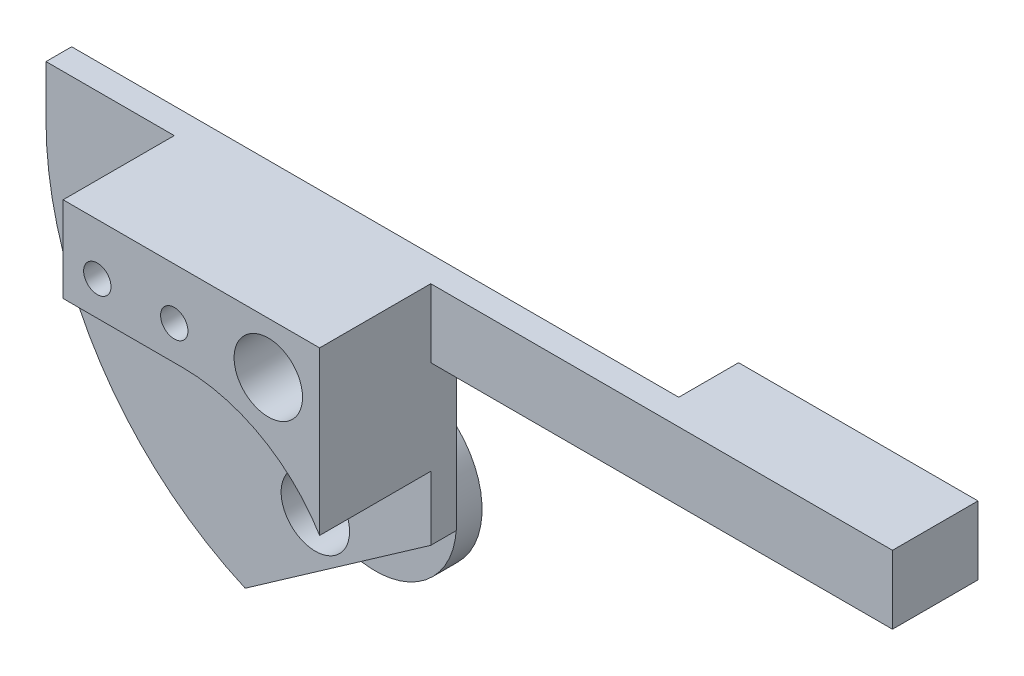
ISO-10303-21;
HEADER;
FILE_DESCRIPTION(('STEP AP214'),'2;1');
FILE_NAME('part.step','',(''),(''),'','','');
FILE_SCHEMA(('AUTOMOTIVE_DESIGN { 1 0 10303 214 1 1 1 1 }'));
ENDSEC;
DATA;
#1=APPLICATION_CONTEXT('core data for automotive mechanical design processes');
#2=APPLICATION_PROTOCOL_DEFINITION('international standard','automotive_design',2000,#1);
#3=PRODUCT_CONTEXT('',#1,'mechanical');
#4=PRODUCT('Part','Part','',(#3));
#5=PRODUCT_RELATED_PRODUCT_CATEGORY('part','',(#4));
#6=PRODUCT_DEFINITION_FORMATION('','',#4);
#7=PRODUCT_DEFINITION_CONTEXT('part definition',#1,'design');
#8=PRODUCT_DEFINITION('design','',#6,#7);
#9=PRODUCT_DEFINITION_SHAPE('','',#8);
#10=(LENGTH_UNIT() NAMED_UNIT(*) SI_UNIT(.MILLI.,.METRE.));
#11=(NAMED_UNIT(*) PLANE_ANGLE_UNIT() SI_UNIT($,.RADIAN.));
#12=(NAMED_UNIT(*) SI_UNIT($,.STERADIAN.) SOLID_ANGLE_UNIT());
#13=UNCERTAINTY_MEASURE_WITH_UNIT(LENGTH_MEASURE(1.E-05),#10,'distance_accuracy_value','');
#14=(GEOMETRIC_REPRESENTATION_CONTEXT(3) GLOBAL_UNCERTAINTY_ASSIGNED_CONTEXT((#13)) GLOBAL_UNIT_ASSIGNED_CONTEXT((#10,
#11,#12)) REPRESENTATION_CONTEXT('',''));
#15=CARTESIAN_POINT('',(0.,0.,0.));
#16=DIRECTION('',(0.,0.,1.));
#17=DIRECTION('',(1.,0.,0.));
#18=AXIS2_PLACEMENT_3D('',#15,#16,#17);
#19=CARTESIAN_POINT('',(35.,68.,0.));
#20=DIRECTION('',(0.,0.,1.));
#21=DIRECTION('',(1.,0.,0.));
#22=AXIS2_PLACEMENT_3D('',#19,#20,#21);
#23=PLANE('',#22);
#24=CARTESIAN_POINT('',(35.,68.,0.));
#25=DIRECTION('',(0.,0.,1.));
#26=DIRECTION('',(1.,0.,0.));
#27=AXIS2_PLACEMENT_3D('',#24,#25,#26);
#28=CIRCLE('',#27,2.);
#29=CARTESIAN_POINT('',(37.,68.,0.));
#30=VERTEX_POINT('',#29);
#31=EDGE_CURVE('E192',#30,#30,#28,.T.);
#32=ORIENTED_EDGE('',*,*,#31,.T.);
#33=EDGE_LOOP('',(#32));
#34=FACE_BOUND('',#33,.T.);
#35=DIRECTION('',(0.,1.,0.));
#36=VECTOR('',#35,1.);
#37=CARTESIAN_POINT('',(38.,48.7321511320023,0.));
#38=LINE('',#37,#36);
#39=CARTESIAN_POINT('',(38.,57.7502243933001,0.));
#40=VERTEX_POINT('',#39);
#41=CARTESIAN_POINT('',(38.,67.,0.));
#42=VERTEX_POINT('',#41);
#43=EDGE_CURVE('E230',#40,#42,#38,.T.);
#44=ORIENTED_EDGE('',*,*,#43,.F.);
#45=DIRECTION('',(-0.819152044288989,-0.57357643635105,0.));
#46=VECTOR('',#45,1.);
#47=CARTESIAN_POINT('',(40.8027890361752,59.7127584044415,0.));
#48=LINE('',#47,#46);
#49=CARTESIAN_POINT('',(35.9923926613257,56.3444826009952,0.));
#50=VERTEX_POINT('',#49);
#51=EDGE_CURVE('E166',#40,#50,#48,.T.);
#52=ORIENTED_EDGE('',*,*,#51,.T.);
#53=CARTESIAN_POINT('',(31.25,56.0757599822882,0.));
#54=DIRECTION('',(0.,0.,1.));
#55=DIRECTION('',(1.,0.,0.));
#56=AXIS2_PLACEMENT_3D('',#53,#54,#55);
#57=CIRCLE('',#56,4.75000000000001);
#58=CARTESIAN_POINT('',(29.3754895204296,51.7112771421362,0.));
#59=VERTEX_POINT('',#58);
#60=EDGE_CURVE('E295',#59,#50,#57,.F.);
#61=ORIENTED_EDGE('',*,*,#60,.F.);
#62=CARTESIAN_POINT('',(27.1472697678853,50.1510608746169,0.));
#63=VERTEX_POINT('',#62);
#64=EDGE_CURVE('E325',#59,#63,#48,.T.);
#65=ORIENTED_EDGE('',*,*,#64,.T.);
#66=CARTESIAN_POINT('',(35.,68.,0.));
#67=DIRECTION('',(0.,0.,1.));
#68=DIRECTION('',(1.,0.,0.));
#69=AXIS2_PLACEMENT_3D('',#66,#67,#68);
#70=CIRCLE('',#69,19.5);
#71=CARTESIAN_POINT('',(15.5,68.,0.));
#72=VERTEX_POINT('',#71);
#73=EDGE_CURVE('E322',#72,#63,#70,.T.);
#74=ORIENTED_EDGE('',*,*,#73,.F.);
#75=DIRECTION('',(0.,-1.,0.));
#76=VECTOR('',#75,1.);
#77=CARTESIAN_POINT('',(15.5,68.,0.));
#78=LINE('',#77,#76);
#79=CARTESIAN_POINT('',(15.5,71.,0.));
#80=VERTEX_POINT('',#79);
#81=EDGE_CURVE('E187',#80,#72,#78,.T.);
#82=ORIENTED_EDGE('',*,*,#81,.F.);
#83=DIRECTION('',(-1.,0.,0.));
#84=VECTOR('',#83,1.);
#85=CARTESIAN_POINT('',(15.5,71.,0.));
#86=LINE('',#85,#84);
#87=CARTESIAN_POINT('',(51.,71.,0.));
#88=VERTEX_POINT('',#87);
#89=EDGE_CURVE('E189',#88,#80,#86,.T.);
#90=ORIENTED_EDGE('',*,*,#89,.F.);
#91=DIRECTION('',(0.,1.,0.));
#92=VECTOR('',#91,1.);
#93=CARTESIAN_POINT('',(51.,71.,0.));
#94=LINE('',#93,#92);
#95=CARTESIAN_POINT('',(51.,67.,0.));
#96=VERTEX_POINT('',#95);
#97=EDGE_CURVE('E63',#96,#88,#94,.T.);
#98=ORIENTED_EDGE('',*,*,#97,.F.);
#99=DIRECTION('',(1.,0.,0.));
#100=VECTOR('',#99,1.);
#101=CARTESIAN_POINT('',(38.,67.,0.));
#102=LINE('',#101,#100);
#103=EDGE_CURVE('E226',#42,#96,#102,.T.);
#104=ORIENTED_EDGE('',*,*,#103,.F.);
#105=EDGE_LOOP('',(#44,#52,#61,#65,#74,#82,#90,#98,#104));
#106=FACE_BOUND('',#105,.T.);
#107=ADVANCED_FACE('F39',(#34,#106),#23,.F.);
#108=CARTESIAN_POINT('',(35.,68.,1.5));
#109=DIRECTION('',(0.,0.,1.));
#110=DIRECTION('',(1.,0.,0.));
#111=AXIS2_PLACEMENT_3D('',#108,#109,#110);
#112=PLANE('',#111);
#113=DIRECTION('',(0.,1.,0.));
#114=VECTOR('',#113,1.);
#115=CARTESIAN_POINT('',(38.,71.,1.5));
#116=LINE('',#115,#114);
#117=CARTESIAN_POINT('',(38.,67.,1.5));
#118=VERTEX_POINT('',#117);
#119=CARTESIAN_POINT('',(38.,71.,1.5));
#120=VERTEX_POINT('',#119);
#121=EDGE_CURVE('E289',#118,#120,#116,.T.);
#122=ORIENTED_EDGE('',*,*,#121,.F.);
#123=DIRECTION('',(1.,0.,0.));
#124=VECTOR('',#123,1.);
#125=CARTESIAN_POINT('',(38.,67.,1.5));
#126=LINE('',#125,#124);
#127=CARTESIAN_POINT('',(65.,67.,1.5));
#128=VERTEX_POINT('',#127);
#129=EDGE_CURVE('E184',#118,#128,#126,.T.);
#130=ORIENTED_EDGE('',*,*,#129,.T.);
#131=DIRECTION('',(0.,1.,0.));
#132=VECTOR('',#131,1.);
#133=CARTESIAN_POINT('',(65.,71.,1.5));
#134=LINE('',#133,#132);
#135=CARTESIAN_POINT('',(65.,71.,1.5));
#136=VERTEX_POINT('',#135);
#137=EDGE_CURVE('E185',#128,#136,#134,.T.);
#138=ORIENTED_EDGE('',*,*,#137,.T.);
#139=DIRECTION('',(-1.,0.,0.));
#140=VECTOR('',#139,1.);
#141=CARTESIAN_POINT('',(15.5,71.,1.5));
#142=LINE('',#141,#140);
#143=EDGE_CURVE('E206',#136,#120,#142,.T.);
#144=ORIENTED_EDGE('',*,*,#143,.T.);
#145=EDGE_LOOP('',(#122,#130,#138,#144));
#146=FACE_BOUND('',#145,.T.);
#147=ADVANCED_FACE('F402',(#146),#112,.T.);
#148=DIRECTION('',(-0.819152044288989,-0.57357643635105,0.));
#149=VECTOR('',#148,1.);
#150=CARTESIAN_POINT('',(38.,57.7502243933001,1.5));
#151=LINE('',#150,#149);
#152=CARTESIAN_POINT('',(38.,57.7502243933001,1.5));
#153=VERTEX_POINT('',#152);
#154=CARTESIAN_POINT('',(27.1472697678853,50.1510608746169,1.5));
#155=VERTEX_POINT('',#154);
#156=EDGE_CURVE('E163',#153,#155,#151,.T.);
#157=ORIENTED_EDGE('',*,*,#156,.F.);
#158=DIRECTION('',(0.,1.,0.));
#159=VECTOR('',#158,1.);
#160=CARTESIAN_POINT('',(38.,48.7321511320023,1.5));
#161=LINE('',#160,#159);
#162=CARTESIAN_POINT('',(38.,61.5,1.5));
#163=VERTEX_POINT('',#162);
#164=EDGE_CURVE('E43',#153,#163,#161,.T.);
#165=ORIENTED_EDGE('',*,*,#164,.T.);
#166=CARTESIAN_POINT('',(30.,56.638888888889,1.5));
#167=DIRECTION('',(0.,0.,-1.));
#168=DIRECTION('',(1.,0.,0.));
#169=AXIS2_PLACEMENT_3D('',#166,#167,#168);
#170=CIRCLE('',#169,9.36111111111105);
#171=CARTESIAN_POINT('',(30.,66.,1.5));
#172=VERTEX_POINT('',#171);
#173=EDGE_CURVE('E251',#172,#163,#170,.T.);
#174=ORIENTED_EDGE('',*,*,#173,.F.);
#175=DIRECTION('',(1.,0.,0.));
#176=VECTOR('',#175,1.);
#177=CARTESIAN_POINT('',(23.,66.,1.5));
#178=LINE('',#177,#176);
#179=CARTESIAN_POINT('',(23.,66.,1.5));
#180=VERTEX_POINT('',#179);
#181=EDGE_CURVE('E260',#180,#172,#178,.T.);
#182=ORIENTED_EDGE('',*,*,#181,.F.);
#183=DIRECTION('',(0.,-1.,0.));
#184=VECTOR('',#183,1.);
#185=CARTESIAN_POINT('',(23.,71.,1.5));
#186=LINE('',#185,#184);
#187=CARTESIAN_POINT('',(23.,71.,1.5));
#188=VERTEX_POINT('',#187);
#189=EDGE_CURVE('E245',#188,#180,#186,.T.);
#190=ORIENTED_EDGE('',*,*,#189,.F.);
#191=CARTESIAN_POINT('',(15.5,71.,1.5));
#192=VERTEX_POINT('',#191);
#193=EDGE_CURVE('E197',#188,#192,#142,.T.);
#194=ORIENTED_EDGE('',*,*,#193,.T.);
#195=DIRECTION('',(0.,-1.,0.));
#196=VECTOR('',#195,1.);
#197=CARTESIAN_POINT('',(15.5,68.,1.5));
#198=LINE('',#197,#196);
#199=CARTESIAN_POINT('',(15.5,68.,1.5));
#200=VERTEX_POINT('',#199);
#201=EDGE_CURVE('E200',#192,#200,#198,.T.);
#202=ORIENTED_EDGE('',*,*,#201,.T.);
#203=CARTESIAN_POINT('',(35.,68.,1.5));
#204=DIRECTION('',(0.,0.,1.));
#205=DIRECTION('',(1.,0.,0.));
#206=AXIS2_PLACEMENT_3D('',#203,#204,#205);
#207=CIRCLE('',#206,19.5);
#208=EDGE_CURVE('E177',#200,#155,#207,.T.);
#209=ORIENTED_EDGE('',*,*,#208,.T.);
#210=EDGE_LOOP('',(#157,#165,#174,#182,#190,#194,#202,#209));
#211=FACE_BOUND('',#210,.T.);
#212=CARTESIAN_POINT('',(31.25,56.0757599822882,1.5));
#213=DIRECTION('',(0.,0.,1.));
#214=DIRECTION('',(1.,0.,0.));
#215=AXIS2_PLACEMENT_3D('',#212,#213,#214);
#216=CIRCLE('',#215,2.);
#217=CARTESIAN_POINT('',(33.25,56.0757599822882,1.5));
#218=VERTEX_POINT('',#217);
#219=EDGE_CURVE('E340',#218,#218,#216,.T.);
#220=ORIENTED_EDGE('',*,*,#219,.F.);
#221=EDGE_LOOP('',(#220));
#222=FACE_BOUND('',#221,.T.);
#223=ADVANCED_FACE('F173',(#211,#222),#112,.T.);
#224=CARTESIAN_POINT('',(35.,68.,1.5));
#225=DIRECTION('',(0.,0.,-1.));
#226=DIRECTION('',(-1.,0.,0.));
#227=AXIS2_PLACEMENT_3D('',#224,#225,#226);
#228=CYLINDRICAL_SURFACE('',#227,19.5);
#229=ORIENTED_EDGE('',*,*,#73,.T.);
#230=DIRECTION('',(0.,0.,-1.));
#231=VECTOR('',#230,1.);
#232=CARTESIAN_POINT('',(27.1472697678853,50.1510608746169,1.5));
#233=LINE('',#232,#231);
#234=EDGE_CURVE('E321',#63,#155,#233,.F.);
#235=ORIENTED_EDGE('',*,*,#234,.T.);
#236=ORIENTED_EDGE('',*,*,#208,.F.);
#237=DIRECTION('',(0.,0.,-1.));
#238=VECTOR('',#237,1.);
#239=CARTESIAN_POINT('',(15.5,68.,1.5));
#240=LINE('',#239,#238);
#241=EDGE_CURVE('E216',#200,#72,#240,.T.);
#242=ORIENTED_EDGE('',*,*,#241,.T.);
#243=EDGE_LOOP('',(#229,#235,#236,#242));
#244=FACE_BOUND('',#243,.T.);
#245=ADVANCED_FACE('F41',(#244),#228,.T.);
#246=CARTESIAN_POINT('',(38.,48.7321511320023,1.5));
#247=DIRECTION('',(-1.,0.,0.));
#248=DIRECTION('',(0.,-1.,0.));
#249=AXIS2_PLACEMENT_3D('',#246,#247,#248);
#250=PLANE('',#249);
#251=ORIENTED_EDGE('',*,*,#164,.F.);
#252=DIRECTION('',(0.,0.,1.));
#253=VECTOR('',#252,1.);
#254=CARTESIAN_POINT('',(38.,57.7502243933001,-2.));
#255=LINE('',#254,#253);
#256=EDGE_CURVE('E160',#40,#153,#255,.T.);
#257=ORIENTED_EDGE('',*,*,#256,.F.);
#258=ORIENTED_EDGE('',*,*,#43,.T.);
#259=DIRECTION('',(0.,0.,-1.));
#260=VECTOR('',#259,1.);
#261=CARTESIAN_POINT('',(38.,67.,1.5));
#262=LINE('',#261,#260);
#263=EDGE_CURVE('E210',#118,#42,#262,.T.);
#264=ORIENTED_EDGE('',*,*,#263,.F.);
#265=ORIENTED_EDGE('',*,*,#121,.T.);
#266=DIRECTION('',(0.,0.,-1.));
#267=VECTOR('',#266,1.);
#268=CARTESIAN_POINT('',(38.,71.,8.));
#269=LINE('',#268,#267);
#270=CARTESIAN_POINT('',(38.,71.,8.));
#271=VERTEX_POINT('',#270);
#272=EDGE_CURVE('E271',#271,#120,#269,.T.);
#273=ORIENTED_EDGE('',*,*,#272,.F.);
#274=DIRECTION('',(0.,1.,0.));
#275=VECTOR('',#274,1.);
#276=CARTESIAN_POINT('',(38.,71.,8.));
#277=LINE('',#276,#275);
#278=CARTESIAN_POINT('',(38.,61.5,8.));
#279=VERTEX_POINT('',#278);
#280=EDGE_CURVE('E255',#279,#271,#277,.T.);
#281=ORIENTED_EDGE('',*,*,#280,.F.);
#282=DIRECTION('',(0.,0.,-1.));
#283=VECTOR('',#282,1.);
#284=CARTESIAN_POINT('',(38.,61.5,8.));
#285=LINE('',#284,#283);
#286=EDGE_CURVE('E183',#279,#163,#285,.T.);
#287=ORIENTED_EDGE('',*,*,#286,.T.);
#288=EDGE_LOOP('',(#251,#257,#258,#264,#265,#273,#281,#287));
#289=FACE_BOUND('',#288,.T.);
#290=ADVANCED_FACE('F180',(#289),#250,.F.);
#291=CARTESIAN_POINT('',(38.,67.,1.5));
#292=DIRECTION('',(0.,1.,0.));
#293=DIRECTION('',(0.,0.,1.));
#294=AXIS2_PLACEMENT_3D('',#291,#292,#293);
#295=PLANE('',#294);
#296=CARTESIAN_POINT('',(58.,67.,-1.));
#297=DIRECTION('',(0.,-1.,0.));
#298=DIRECTION('',(0.,0.,-1.));
#299=AXIS2_PLACEMENT_3D('',#296,#297,#298);
#300=CIRCLE('',#299,2.);
#301=CARTESIAN_POINT('',(58.,67.,-3.));
#302=VERTEX_POINT('',#301);
#303=EDGE_CURVE('E347',#302,#302,#300,.T.);
#304=ORIENTED_EDGE('',*,*,#303,.F.);
#305=EDGE_LOOP('',(#304));
#306=FACE_BOUND('',#305,.T.);
#307=ORIENTED_EDGE('',*,*,#103,.T.);
#308=DIRECTION('',(0.,0.,1.));
#309=VECTOR('',#308,1.);
#310=CARTESIAN_POINT('',(51.,67.,-3.5));
#311=LINE('',#310,#309);
#312=CARTESIAN_POINT('',(51.,67.,-3.5));
#313=VERTEX_POINT('',#312);
#314=EDGE_CURVE('E246',#313,#96,#311,.T.);
#315=ORIENTED_EDGE('',*,*,#314,.F.);
#316=DIRECTION('',(-1.,0.,0.));
#317=VECTOR('',#316,1.);
#318=CARTESIAN_POINT('',(65.,67.,-3.5));
#319=LINE('',#318,#317);
#320=CARTESIAN_POINT('',(65.,67.,-3.5));
#321=VERTEX_POINT('',#320);
#322=EDGE_CURVE('E354',#321,#313,#319,.T.);
#323=ORIENTED_EDGE('',*,*,#322,.F.);
#324=DIRECTION('',(0.,0.,-1.));
#325=VECTOR('',#324,1.);
#326=CARTESIAN_POINT('',(65.,67.,1.5));
#327=LINE('',#326,#325);
#328=EDGE_CURVE('E208',#128,#321,#327,.T.);
#329=ORIENTED_EDGE('',*,*,#328,.F.);
#330=ORIENTED_EDGE('',*,*,#129,.F.);
#331=ORIENTED_EDGE('',*,*,#263,.T.);
#332=EDGE_LOOP('',(#307,#315,#323,#329,#330,#331));
#333=FACE_BOUND('',#332,.T.);
#334=ADVANCED_FACE('F419',(#306,#333),#295,.F.);
#335=CARTESIAN_POINT('',(65.,71.,1.5));
#336=DIRECTION('',(-1.,0.,0.));
#337=DIRECTION('',(0.,0.,1.));
#338=AXIS2_PLACEMENT_3D('',#335,#336,#337);
#339=PLANE('',#338);
#340=ORIENTED_EDGE('',*,*,#328,.T.);
#341=DIRECTION('',(0.,-1.,0.));
#342=VECTOR('',#341,1.);
#343=CARTESIAN_POINT('',(65.,71.,-3.5));
#344=LINE('',#343,#342);
#345=CARTESIAN_POINT('',(65.,71.,-3.5));
#346=VERTEX_POINT('',#345);
#347=EDGE_CURVE('E233',#346,#321,#344,.T.);
#348=ORIENTED_EDGE('',*,*,#347,.F.);
#349=DIRECTION('',(0.,0.,-1.));
#350=VECTOR('',#349,1.);
#351=CARTESIAN_POINT('',(65.,71.,1.5));
#352=LINE('',#351,#350);
#353=EDGE_CURVE('E211',#136,#346,#352,.T.);
#354=ORIENTED_EDGE('',*,*,#353,.F.);
#355=ORIENTED_EDGE('',*,*,#137,.F.);
#356=EDGE_LOOP('',(#340,#348,#354,#355));
#357=FACE_BOUND('',#356,.T.);
#358=ADVANCED_FACE('F416',(#357),#339,.F.);
#359=CARTESIAN_POINT('',(15.5,71.,1.5));
#360=DIRECTION('',(0.,-1.,0.));
#361=DIRECTION('',(0.,0.,-1.));
#362=AXIS2_PLACEMENT_3D('',#359,#360,#361);
#363=PLANE('',#362);
#364=ORIENTED_EDGE('',*,*,#353,.T.);
#365=DIRECTION('',(1.,0.,0.));
#366=VECTOR('',#365,1.);
#367=CARTESIAN_POINT('',(65.,71.,-3.5));
#368=LINE('',#367,#366);
#369=CARTESIAN_POINT('',(51.,71.,-3.5));
#370=VERTEX_POINT('',#369);
#371=EDGE_CURVE('E240',#370,#346,#368,.T.);
#372=ORIENTED_EDGE('',*,*,#371,.F.);
#373=DIRECTION('',(0.,0.,1.));
#374=VECTOR('',#373,1.);
#375=CARTESIAN_POINT('',(51.,71.,-3.5));
#376=LINE('',#375,#374);
#377=EDGE_CURVE('E235',#370,#88,#376,.T.);
#378=ORIENTED_EDGE('',*,*,#377,.T.);
#379=ORIENTED_EDGE('',*,*,#89,.T.);
#380=DIRECTION('',(0.,0.,-1.));
#381=VECTOR('',#380,1.);
#382=CARTESIAN_POINT('',(15.5,71.,1.5));
#383=LINE('',#382,#381);
#384=EDGE_CURVE('E213',#192,#80,#383,.T.);
#385=ORIENTED_EDGE('',*,*,#384,.F.);
#386=ORIENTED_EDGE('',*,*,#193,.F.);
#387=DIRECTION('',(0.,0.,-1.));
#388=VECTOR('',#387,1.);
#389=CARTESIAN_POINT('',(23.,71.,8.));
#390=LINE('',#389,#388);
#391=CARTESIAN_POINT('',(23.,71.,8.));
#392=VERTEX_POINT('',#391);
#393=EDGE_CURVE('E259',#392,#188,#390,.T.);
#394=ORIENTED_EDGE('',*,*,#393,.F.);
#395=DIRECTION('',(-1.,0.,0.));
#396=VECTOR('',#395,1.);
#397=CARTESIAN_POINT('',(23.,71.,8.));
#398=LINE('',#397,#396);
#399=EDGE_CURVE('E257',#271,#392,#398,.T.);
#400=ORIENTED_EDGE('',*,*,#399,.F.);
#401=ORIENTED_EDGE('',*,*,#272,.T.);
#402=ORIENTED_EDGE('',*,*,#143,.F.);
#403=EDGE_LOOP('',(#364,#372,#378,#379,#385,#386,#394,#400,#401,#402));
#404=FACE_BOUND('',#403,.T.);
#405=ADVANCED_FACE('F311',(#404),#363,.F.);
#406=CARTESIAN_POINT('',(15.5,68.,1.5));
#407=DIRECTION('',(1.,0.,0.));
#408=DIRECTION('',(0.,0.,-1.));
#409=AXIS2_PLACEMENT_3D('',#406,#407,#408);
#410=PLANE('',#409);
#411=ORIENTED_EDGE('',*,*,#81,.T.);
#412=ORIENTED_EDGE('',*,*,#241,.F.);
#413=ORIENTED_EDGE('',*,*,#201,.F.);
#414=ORIENTED_EDGE('',*,*,#384,.T.);
#415=EDGE_LOOP('',(#411,#412,#413,#414));
#416=FACE_BOUND('',#415,.T.);
#417=ADVANCED_FACE('F317',(#416),#410,.F.);
#418=CARTESIAN_POINT('',(35.,68.,1.5));
#419=DIRECTION('',(0.,0.,-1.));
#420=DIRECTION('',(-1.,0.,0.));
#421=AXIS2_PLACEMENT_3D('',#418,#419,#420);
#422=CYLINDRICAL_SURFACE('',#421,2.);
#423=ORIENTED_EDGE('',*,*,#31,.F.);
#424=EDGE_LOOP('',(#423));
#425=FACE_BOUND('',#424,.T.);
#426=CARTESIAN_POINT('',(35.,68.,8.));
#427=DIRECTION('',(0.,0.,1.));
#428=DIRECTION('',(1.,0.,0.));
#429=AXIS2_PLACEMENT_3D('',#426,#427,#428);
#430=CIRCLE('',#429,2.);
#431=CARTESIAN_POINT('',(37.,68.,8.));
#432=VERTEX_POINT('',#431);
#433=EDGE_CURVE('E242',#432,#432,#430,.T.);
#434=ORIENTED_EDGE('',*,*,#433,.T.);
#435=EDGE_LOOP('',(#434));
#436=FACE_BOUND('',#435,.T.);
#437=ADVANCED_FACE('F413',(#425,#436),#422,.F.);
#438=CARTESIAN_POINT('',(30.,56.638888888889,8.));
#439=DIRECTION('',(0.,0.,1.));
#440=DIRECTION('',(1.,0.,0.));
#441=AXIS2_PLACEMENT_3D('',#438,#439,#440);
#442=PLANE('',#441);
#443=CARTESIAN_POINT('',(25.,68.,8.));
#444=DIRECTION('',(0.,0.,1.));
#445=DIRECTION('',(1.,0.,0.));
#446=AXIS2_PLACEMENT_3D('',#443,#444,#445);
#447=CIRCLE('',#446,0.799999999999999);
#448=CARTESIAN_POINT('',(25.8,68.,8.));
#449=VERTEX_POINT('',#448);
#450=EDGE_CURVE('E324',#449,#449,#447,.T.);
#451=ORIENTED_EDGE('',*,*,#450,.F.);
#452=EDGE_LOOP('',(#451));
#453=FACE_BOUND('',#452,.T.);
#454=CARTESIAN_POINT('',(29.5,68.,8.));
#455=DIRECTION('',(0.,0.,1.));
#456=DIRECTION('',(1.,0.,0.));
#457=AXIS2_PLACEMENT_3D('',#454,#455,#456);
#458=CIRCLE('',#457,0.799999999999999);
#459=CARTESIAN_POINT('',(30.3,68.,8.));
#460=VERTEX_POINT('',#459);
#461=EDGE_CURVE('E334',#460,#460,#458,.T.);
#462=ORIENTED_EDGE('',*,*,#461,.F.);
#463=EDGE_LOOP('',(#462));
#464=FACE_BOUND('',#463,.T.);
#465=DIRECTION('',(0.,-1.,0.));
#466=VECTOR('',#465,1.);
#467=CARTESIAN_POINT('',(23.,71.,8.));
#468=LINE('',#467,#466);
#469=CARTESIAN_POINT('',(23.,66.,8.));
#470=VERTEX_POINT('',#469);
#471=EDGE_CURVE('E247',#392,#470,#468,.T.);
#472=ORIENTED_EDGE('',*,*,#471,.T.);
#473=DIRECTION('',(1.,0.,0.));
#474=VECTOR('',#473,1.);
#475=CARTESIAN_POINT('',(23.,66.,8.));
#476=LINE('',#475,#474);
#477=CARTESIAN_POINT('',(30.,66.,8.));
#478=VERTEX_POINT('',#477);
#479=EDGE_CURVE('E250',#470,#478,#476,.T.);
#480=ORIENTED_EDGE('',*,*,#479,.T.);
#481=CARTESIAN_POINT('',(30.,56.638888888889,8.));
#482=DIRECTION('',(0.,0.,-1.));
#483=DIRECTION('',(1.,0.,0.));
#484=AXIS2_PLACEMENT_3D('',#481,#482,#483);
#485=CIRCLE('',#484,9.36111111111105);
#486=EDGE_CURVE('E253',#478,#279,#485,.T.);
#487=ORIENTED_EDGE('',*,*,#486,.T.);
#488=ORIENTED_EDGE('',*,*,#280,.T.);
#489=ORIENTED_EDGE('',*,*,#399,.T.);
#490=EDGE_LOOP('',(#472,#480,#487,#488,#489));
#491=FACE_BOUND('',#490,.T.);
#492=ORIENTED_EDGE('',*,*,#433,.F.);
#493=EDGE_LOOP('',(#492));
#494=FACE_BOUND('',#493,.T.);
#495=ADVANCED_FACE('F386',(#453,#464,#491,#494),#442,.T.);
#496=CARTESIAN_POINT('',(23.,71.,8.));
#497=DIRECTION('',(1.,0.,0.));
#498=DIRECTION('',(0.,0.,-1.));
#499=AXIS2_PLACEMENT_3D('',#496,#497,#498);
#500=PLANE('',#499);
#501=ORIENTED_EDGE('',*,*,#189,.T.);
#502=DIRECTION('',(0.,0.,-1.));
#503=VECTOR('',#502,1.);
#504=CARTESIAN_POINT('',(23.,66.,8.));
#505=LINE('',#504,#503);
#506=EDGE_CURVE('E273',#470,#180,#505,.T.);
#507=ORIENTED_EDGE('',*,*,#506,.F.);
#508=ORIENTED_EDGE('',*,*,#471,.F.);
#509=ORIENTED_EDGE('',*,*,#393,.T.);
#510=EDGE_LOOP('',(#501,#507,#508,#509));
#511=FACE_BOUND('',#510,.T.);
#512=ADVANCED_FACE('F305',(#511),#500,.F.);
#513=CARTESIAN_POINT('',(23.,66.,8.));
#514=DIRECTION('',(0.,1.,0.));
#515=DIRECTION('',(-1.,0.,0.));
#516=AXIS2_PLACEMENT_3D('',#513,#514,#515);
#517=PLANE('',#516);
#518=ORIENTED_EDGE('',*,*,#181,.T.);
#519=DIRECTION('',(0.,0.,-1.));
#520=VECTOR('',#519,1.);
#521=CARTESIAN_POINT('',(30.,66.,8.));
#522=LINE('',#521,#520);
#523=EDGE_CURVE('E270',#478,#172,#522,.T.);
#524=ORIENTED_EDGE('',*,*,#523,.F.);
#525=ORIENTED_EDGE('',*,*,#479,.F.);
#526=ORIENTED_EDGE('',*,*,#506,.T.);
#527=EDGE_LOOP('',(#518,#524,#525,#526));
#528=FACE_BOUND('',#527,.T.);
#529=ADVANCED_FACE('F382',(#528),#517,.F.);
#530=CARTESIAN_POINT('',(30.,56.638888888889,8.));
#531=DIRECTION('',(0.,0.,-1.));
#532=DIRECTION('',(-1.,0.,0.));
#533=AXIS2_PLACEMENT_3D('',#530,#531,#532);
#534=CYLINDRICAL_SURFACE('',#533,9.36111111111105);
#535=ORIENTED_EDGE('',*,*,#173,.T.);
#536=ORIENTED_EDGE('',*,*,#286,.F.);
#537=ORIENTED_EDGE('',*,*,#486,.F.);
#538=ORIENTED_EDGE('',*,*,#523,.T.);
#539=EDGE_LOOP('',(#535,#536,#537,#538));
#540=FACE_BOUND('',#539,.T.);
#541=ADVANCED_FACE('F389',(#540),#534,.F.);
#542=CARTESIAN_POINT('',(51.,71.,-3.5));
#543=DIRECTION('',(1.,0.,0.));
#544=DIRECTION('',(0.,0.,-1.));
#545=AXIS2_PLACEMENT_3D('',#542,#543,#544);
#546=PLANE('',#545);
#547=ORIENTED_EDGE('',*,*,#97,.T.);
#548=ORIENTED_EDGE('',*,*,#377,.F.);
#549=DIRECTION('',(0.,1.,0.));
#550=VECTOR('',#549,1.);
#551=CARTESIAN_POINT('',(51.,71.,-3.5));
#552=LINE('',#551,#550);
#553=EDGE_CURVE('E355',#313,#370,#552,.T.);
#554=ORIENTED_EDGE('',*,*,#553,.F.);
#555=ORIENTED_EDGE('',*,*,#314,.T.);
#556=EDGE_LOOP('',(#547,#548,#554,#555));
#557=FACE_BOUND('',#556,.T.);
#558=ADVANCED_FACE('F391',(#557),#546,.F.);
#559=CARTESIAN_POINT('',(0.,0.,-3.5));
#560=DIRECTION('',(0.,0.,-1.));
#561=DIRECTION('',(-1.,0.,0.));
#562=AXIS2_PLACEMENT_3D('',#559,#560,#561);
#563=PLANE('',#562);
#564=ORIENTED_EDGE('',*,*,#347,.T.);
#565=ORIENTED_EDGE('',*,*,#322,.T.);
#566=ORIENTED_EDGE('',*,*,#553,.T.);
#567=ORIENTED_EDGE('',*,*,#371,.T.);
#568=EDGE_LOOP('',(#564,#565,#566,#567));
#569=FACE_BOUND('',#568,.T.);
#570=ADVANCED_FACE('F397',(#569),#563,.T.);
#571=CARTESIAN_POINT('',(58.,70.,-1.));
#572=DIRECTION('',(0.,-1.,0.));
#573=DIRECTION('',(0.,0.,-1.));
#574=AXIS2_PLACEMENT_3D('',#571,#572,#573);
#575=CYLINDRICAL_SURFACE('',#574,2.);
#576=CARTESIAN_POINT('',(58.,70.,-1.));
#577=DIRECTION('',(0.,-1.,0.));
#578=DIRECTION('',(0.,0.,-1.));
#579=AXIS2_PLACEMENT_3D('',#576,#577,#578);
#580=CIRCLE('',#579,2.);
#581=CARTESIAN_POINT('',(58.,70.,-3.));
#582=VERTEX_POINT('',#581);
#583=EDGE_CURVE('E234',#582,#582,#580,.T.);
#584=ORIENTED_EDGE('',*,*,#583,.F.);
#585=EDGE_LOOP('',(#584));
#586=FACE_BOUND('',#585,.T.);
#587=ORIENTED_EDGE('',*,*,#303,.T.);
#588=EDGE_LOOP('',(#587));
#589=FACE_BOUND('',#588,.T.);
#590=ADVANCED_FACE('F499',(#586,#589),#575,.F.);
#591=CARTESIAN_POINT('',(58.,70.,-1.));
#592=DIRECTION('',(0.,-1.,0.));
#593=DIRECTION('',(0.,0.,-1.));
#594=AXIS2_PLACEMENT_3D('',#591,#592,#593);
#595=PLANE('',#594);
#596=ORIENTED_EDGE('',*,*,#583,.T.);
#597=EDGE_LOOP('',(#596));
#598=FACE_BOUND('',#597,.T.);
#599=ADVANCED_FACE('F514',(#598),#595,.T.);
#600=CARTESIAN_POINT('',(31.25,56.0757599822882,-3.5));
#601=DIRECTION('',(0.,0.,-1.));
#602=DIRECTION('',(-1.,0.,0.));
#603=AXIS2_PLACEMENT_3D('',#600,#601,#602);
#604=PLANE('',#603);
#605=CARTESIAN_POINT('',(31.25,56.0757599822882,-3.5));
#606=DIRECTION('',(0.,0.,-1.));
#607=DIRECTION('',(-1.,0.,0.));
#608=AXIS2_PLACEMENT_3D('',#605,#606,#607);
#609=CIRCLE('',#608,4.75000000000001);
#610=CARTESIAN_POINT('',(26.5,56.0757599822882,-3.5));
#611=VERTEX_POINT('',#610);
#612=EDGE_CURVE('E344',#611,#611,#609,.T.);
#613=ORIENTED_EDGE('',*,*,#612,.T.);
#614=EDGE_LOOP('',(#613));
#615=FACE_BOUND('',#614,.T.);
#616=CARTESIAN_POINT('',(31.25,56.0757599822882,-3.5));
#617=DIRECTION('',(0.,0.,-1.));
#618=DIRECTION('',(-1.,0.,0.));
#619=AXIS2_PLACEMENT_3D('',#616,#617,#618);
#620=CIRCLE('',#619,2.);
#621=CARTESIAN_POINT('',(29.25,56.0757599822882,-3.5));
#622=VERTEX_POINT('',#621);
#623=EDGE_CURVE('E341',#622,#622,#620,.T.);
#624=ORIENTED_EDGE('',*,*,#623,.F.);
#625=EDGE_LOOP('',(#624));
#626=FACE_BOUND('',#625,.T.);
#627=ADVANCED_FACE('F524',(#615,#626),#604,.T.);
#628=CARTESIAN_POINT('',(31.25,56.0757599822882,-3.5));
#629=DIRECTION('',(0.,0.,1.));
#630=DIRECTION('',(1.,0.,0.));
#631=AXIS2_PLACEMENT_3D('',#628,#629,#630);
#632=CYLINDRICAL_SURFACE('',#631,4.75000000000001);
#633=ORIENTED_EDGE('',*,*,#612,.F.);
#634=EDGE_LOOP('',(#633));
#635=FACE_BOUND('',#634,.T.);
#636=CARTESIAN_POINT('',(31.25,56.0757599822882,-2.));
#637=DIRECTION('',(0.,0.,1.));
#638=DIRECTION('',(1.,0.,0.));
#639=AXIS2_PLACEMENT_3D('',#636,#637,#638);
#640=CIRCLE('',#639,4.75000000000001);
#641=CARTESIAN_POINT('',(29.3754895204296,51.7112771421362,-2.));
#642=VERTEX_POINT('',#641);
#643=CARTESIAN_POINT('',(35.9923926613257,56.3444826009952,-2.));
#644=VERTEX_POINT('',#643);
#645=EDGE_CURVE('E297',#642,#644,#640,.T.);
#646=ORIENTED_EDGE('',*,*,#645,.F.);
#647=DIRECTION('',(0.,0.,1.));
#648=VECTOR('',#647,1.);
#649=CARTESIAN_POINT('',(29.3754895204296,51.7112771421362,-3.5));
#650=LINE('',#649,#648);
#651=EDGE_CURVE('E11',#642,#59,#650,.T.);
#652=ORIENTED_EDGE('',*,*,#651,.T.);
#653=ORIENTED_EDGE('',*,*,#60,.T.);
#654=DIRECTION('',(0.,0.,1.));
#655=VECTOR('',#654,1.);
#656=CARTESIAN_POINT('',(35.9923926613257,56.3444826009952,-3.5));
#657=LINE('',#656,#655);
#658=EDGE_CURVE('E49',#50,#644,#657,.F.);
#659=ORIENTED_EDGE('',*,*,#658,.T.);
#660=EDGE_LOOP('',(#646,#652,#653,#659));
#661=FACE_BOUND('',#660,.T.);
#662=ADVANCED_FACE('F376',(#635,#661),#632,.T.);
#663=CARTESIAN_POINT('',(31.25,56.0757599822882,-3.5));
#664=DIRECTION('',(0.,0.,1.));
#665=DIRECTION('',(1.,0.,0.));
#666=AXIS2_PLACEMENT_3D('',#663,#664,#665);
#667=CYLINDRICAL_SURFACE('',#666,2.);
#668=ORIENTED_EDGE('',*,*,#623,.T.);
#669=EDGE_LOOP('',(#668));
#670=FACE_BOUND('',#669,.T.);
#671=ORIENTED_EDGE('',*,*,#219,.T.);
#672=EDGE_LOOP('',(#671));
#673=FACE_BOUND('',#672,.T.);
#674=ADVANCED_FACE('F542',(#670,#673),#667,.F.);
#675=CARTESIAN_POINT('',(29.5,68.,4.));
#676=DIRECTION('',(0.,0.,1.));
#677=DIRECTION('',(1.,0.,0.));
#678=AXIS2_PLACEMENT_3D('',#675,#676,#677);
#679=CONICAL_SURFACE('',#678,0.799999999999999,1.02974425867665);
#680=CARTESIAN_POINT('',(29.5,68.,3.51931150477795));
#681=VERTEX_POINT('',#680);
#682=VERTEX_LOOP('',#681);
#683=FACE_BOUND('',#682,.T.);
#684=CARTESIAN_POINT('',(29.5,68.,4.));
#685=DIRECTION('',(0.,0.,1.));
#686=DIRECTION('',(1.,0.,0.));
#687=AXIS2_PLACEMENT_3D('',#684,#685,#686);
#688=CIRCLE('',#687,0.799999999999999);
#689=CARTESIAN_POINT('',(30.3,68.,4.));
#690=VERTEX_POINT('',#689);
#691=EDGE_CURVE('E337',#690,#690,#688,.T.);
#692=ORIENTED_EDGE('',*,*,#691,.T.);
#693=EDGE_LOOP('',(#692));
#694=FACE_BOUND('',#693,.T.);
#695=ADVANCED_FACE('F547',(#683,#694),#679,.F.);
#696=CARTESIAN_POINT('',(29.5,68.,8.));
#697=DIRECTION('',(0.,0.,1.));
#698=DIRECTION('',(1.,0.,0.));
#699=AXIS2_PLACEMENT_3D('',#696,#697,#698);
#700=CYLINDRICAL_SURFACE('',#699,0.799999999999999);
#701=ORIENTED_EDGE('',*,*,#691,.F.);
#702=EDGE_LOOP('',(#701));
#703=FACE_BOUND('',#702,.T.);
#704=ORIENTED_EDGE('',*,*,#461,.T.);
#705=EDGE_LOOP('',(#704));
#706=FACE_BOUND('',#705,.T.);
#707=ADVANCED_FACE('F564',(#703,#706),#700,.F.);
#708=CARTESIAN_POINT('',(25.,68.,4.));
#709=DIRECTION('',(0.,0.,1.));
#710=DIRECTION('',(1.,0.,0.));
#711=AXIS2_PLACEMENT_3D('',#708,#709,#710);
#712=CONICAL_SURFACE('',#711,0.799999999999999,1.02974425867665);
#713=CARTESIAN_POINT('',(25.,68.,3.51931150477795));
#714=VERTEX_POINT('',#713);
#715=VERTEX_LOOP('',#714);
#716=FACE_BOUND('',#715,.T.);
#717=CARTESIAN_POINT('',(25.,68.,4.));
#718=DIRECTION('',(0.,0.,1.));
#719=DIRECTION('',(1.,0.,0.));
#720=AXIS2_PLACEMENT_3D('',#717,#718,#719);
#721=CIRCLE('',#720,0.799999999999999);
#722=CARTESIAN_POINT('',(25.8,68.,4.));
#723=VERTEX_POINT('',#722);
#724=EDGE_CURVE('E328',#723,#723,#721,.T.);
#725=ORIENTED_EDGE('',*,*,#724,.T.);
#726=EDGE_LOOP('',(#725));
#727=FACE_BOUND('',#726,.T.);
#728=ADVANCED_FACE('F575',(#716,#727),#712,.F.);
#729=CARTESIAN_POINT('',(25.,68.,8.));
#730=DIRECTION('',(0.,0.,1.));
#731=DIRECTION('',(1.,0.,0.));
#732=AXIS2_PLACEMENT_3D('',#729,#730,#731);
#733=CYLINDRICAL_SURFACE('',#732,0.799999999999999);
#734=ORIENTED_EDGE('',*,*,#724,.F.);
#735=EDGE_LOOP('',(#734));
#736=FACE_BOUND('',#735,.T.);
#737=ORIENTED_EDGE('',*,*,#450,.T.);
#738=EDGE_LOOP('',(#737));
#739=FACE_BOUND('',#738,.T.);
#740=ADVANCED_FACE('F586',(#736,#739),#733,.F.);
#741=CARTESIAN_POINT('',(38.,57.7502243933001,-2.));
#742=DIRECTION('',(-0.57357643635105,0.819152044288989,0.));
#743=DIRECTION('',(-0.819152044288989,-0.57357643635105,0.));
#744=AXIS2_PLACEMENT_3D('',#741,#742,#743);
#745=PLANE('',#744);
#746=ORIENTED_EDGE('',*,*,#64,.F.);
#747=ORIENTED_EDGE('',*,*,#651,.F.);
#748=DIRECTION('',(-0.819152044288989,-0.57357643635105,0.));
#749=VECTOR('',#748,1.);
#750=CARTESIAN_POINT('',(38.,57.7502243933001,-2.));
#751=LINE('',#750,#749);
#752=EDGE_CURVE('E55',#644,#642,#751,.T.);
#753=ORIENTED_EDGE('',*,*,#752,.F.);
#754=ORIENTED_EDGE('',*,*,#658,.F.);
#755=ORIENTED_EDGE('',*,*,#51,.F.);
#756=ORIENTED_EDGE('',*,*,#256,.T.);
#757=ORIENTED_EDGE('',*,*,#156,.T.);
#758=ORIENTED_EDGE('',*,*,#234,.F.);
#759=EDGE_LOOP('',(#746,#747,#753,#754,#755,#756,#757,#758));
#760=FACE_BOUND('',#759,.T.);
#761=ADVANCED_FACE('F162',(#760),#745,.F.);
#762=CARTESIAN_POINT('',(0.,0.,-2.));
#763=DIRECTION('',(0.,0.,1.));
#764=DIRECTION('',(1.,0.,0.));
#765=AXIS2_PLACEMENT_3D('',#762,#763,#764);
#766=PLANE('',#765);
#767=ORIENTED_EDGE('',*,*,#645,.T.);
#768=ORIENTED_EDGE('',*,*,#752,.T.);
#769=EDGE_LOOP('',(#767,#768));
#770=FACE_BOUND('',#769,.T.);
#771=ADVANCED_FACE('F609',(#770),#766,.T.);
#772=CLOSED_SHELL('',(#107,#147,#223,#245,#290,#334,#358,#405,#417,#437,#495,#512,#529,#541,
#558,#570,#590,#599,#627,#662,#674,#695,#707,#728,#740,#761,#771));
#773=MANIFOLD_SOLID_BREP('B2',#772);
#774=ADVANCED_BREP_SHAPE_REPRESENTATION('',(#18,#773),#14);
#775=SHAPE_DEFINITION_REPRESENTATION(#9,#774);
ENDSEC;
END-ISO-10303-21;
